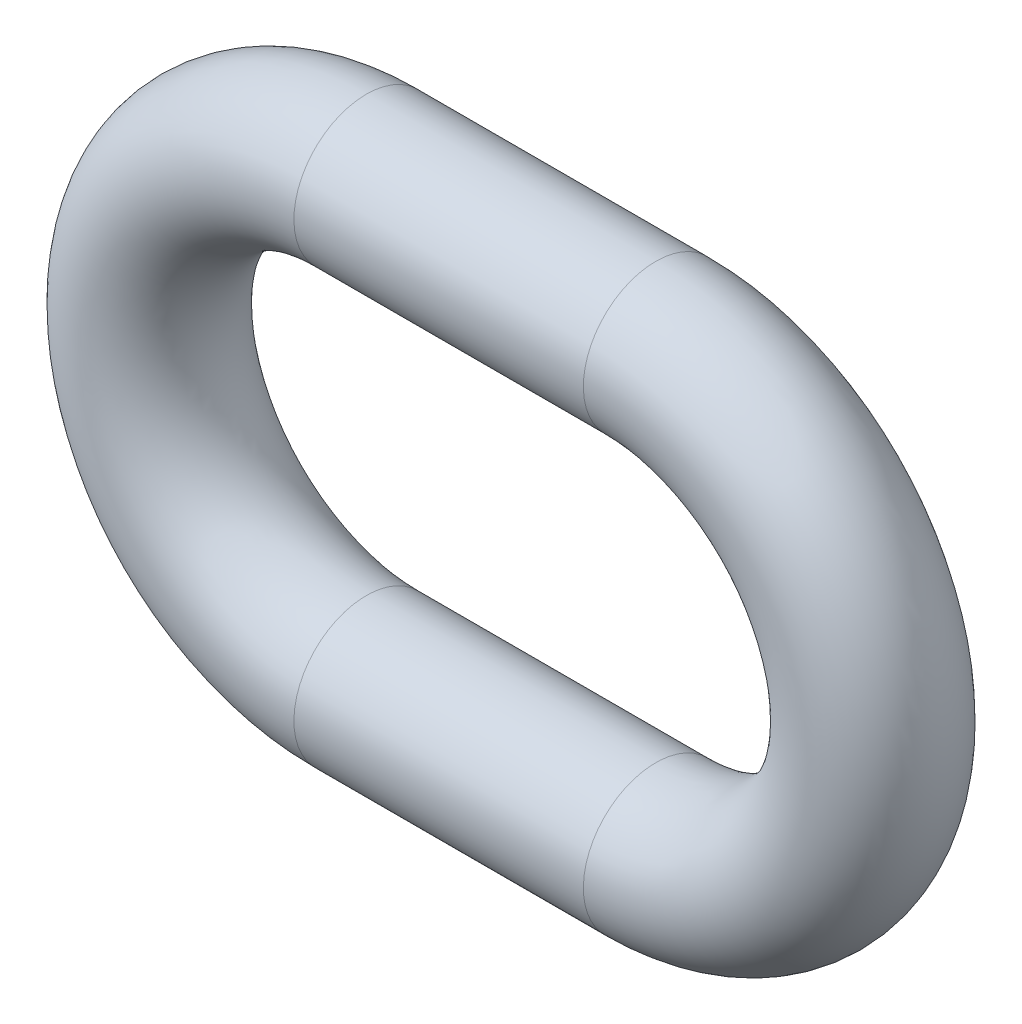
from build123d import *

# Parameters (mm, degrees)
KREISQUERSCHNITT_R = 5


with BuildPart() as part:
    # Kettenglied: sweep along a path in Skizze3
    with BuildLine(Plane.XY) as kettenglied_path:
        Line((-10, 15), (10, 15))
        ThreePointArc((10, 15), (25, 0), (10, -15))
        Line((10, -15), (-10, -15))
        ThreePointArc((-10, -15), (-25, 0), (-10, 15))
    # Kreisquerschnitt → Kettenglied (sweep)
    with BuildSketch(Plane(origin=(0, 0, 0), x_dir=(0, 0, -1), z_dir=(1, 0, 0))):
        with Locations((0, 15)):
            Circle(KREISQUERSCHNITT_R)
    sweep(path=kettenglied_path.line)


solid = part.part
